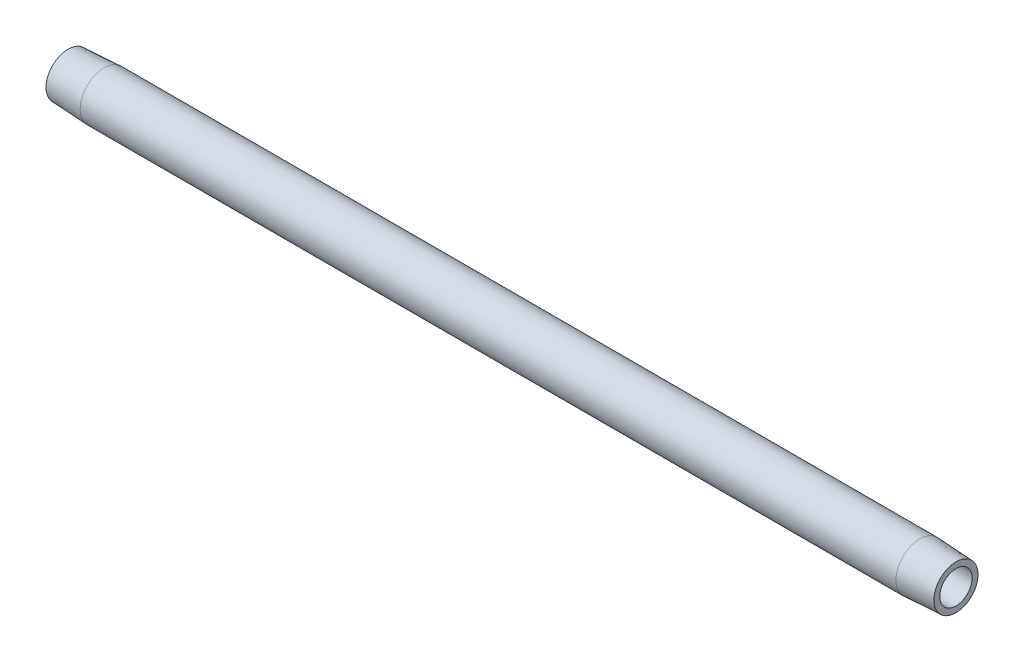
from build123d import *


with BuildPart() as part:
    # Sketch1 → Revolve1 (revolve)
    with BuildSketch(Plane(origin=(0, 0, 0), x_dir=(1, 0, 0), z_dir=(0, 1, 0)), mode=Mode.PRIVATE) as revolve1_sk:
        Polygon((254, 4.622776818), (0, 4.622776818), (0, 6.317526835), (10.3124, 6.857976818), (243.6876, 6.857976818), (254, 6.317526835), align=None)
    revolve(revolve1_sk.sketch.rotate(Axis((-6.375994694, 0, 0), (1, 0, 0)), 180), axis=Axis((-6.375994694, 0, 0), (1, 0, 0)))


solid = part.part
